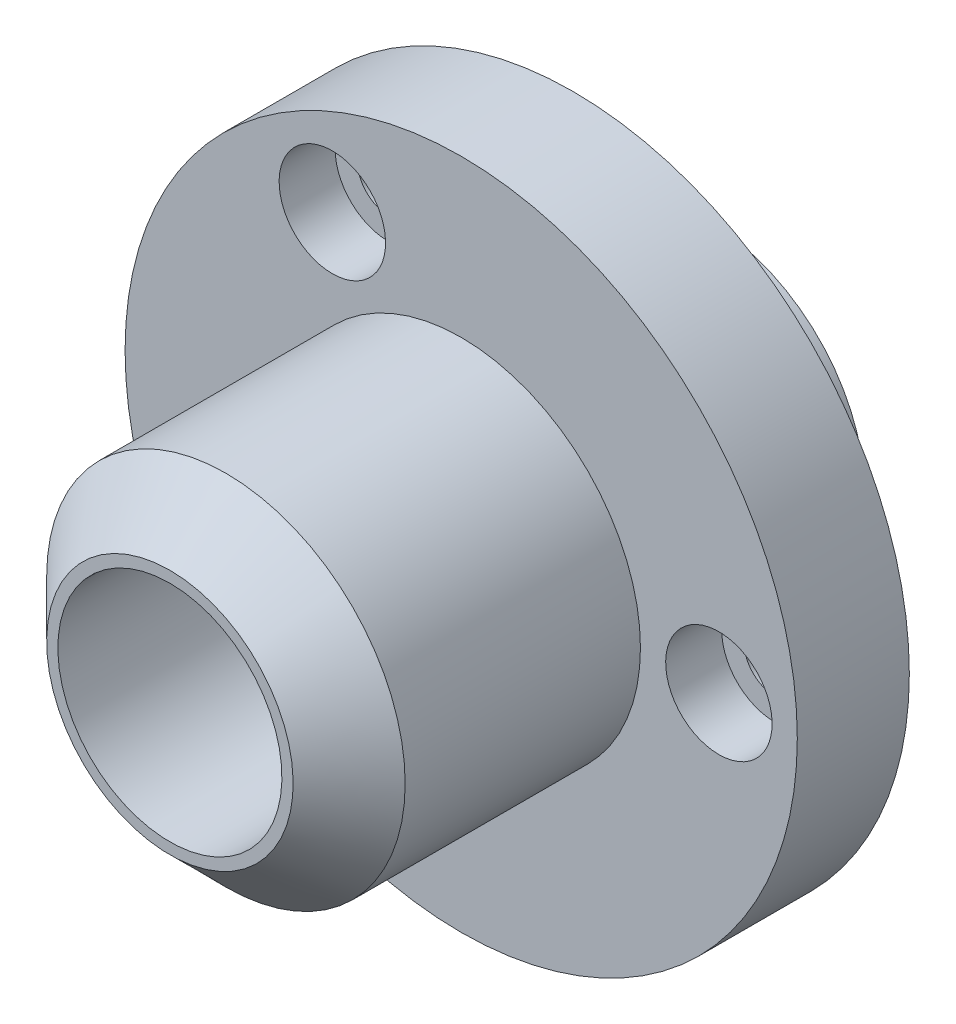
ISO-10303-21;
HEADER;
FILE_DESCRIPTION(('STEP AP214'),'2;1');
FILE_NAME('part.step','',(''),(''),'','','');
FILE_SCHEMA(('AUTOMOTIVE_DESIGN { 1 0 10303 214 1 1 1 1 }'));
ENDSEC;
DATA;
#1=APPLICATION_CONTEXT('core data for automotive mechanical design processes');
#2=APPLICATION_PROTOCOL_DEFINITION('international standard','automotive_design',2000,#1);
#3=PRODUCT_CONTEXT('',#1,'mechanical');
#4=PRODUCT('Part','Part','',(#3));
#5=PRODUCT_RELATED_PRODUCT_CATEGORY('part','',(#4));
#6=PRODUCT_DEFINITION_FORMATION('','',#4);
#7=PRODUCT_DEFINITION_CONTEXT('part definition',#1,'design');
#8=PRODUCT_DEFINITION('design','',#6,#7);
#9=PRODUCT_DEFINITION_SHAPE('','',#8);
#10=(LENGTH_UNIT() NAMED_UNIT(*) SI_UNIT(.MILLI.,.METRE.));
#11=(NAMED_UNIT(*) PLANE_ANGLE_UNIT() SI_UNIT($,.RADIAN.));
#12=(NAMED_UNIT(*) SI_UNIT($,.STERADIAN.) SOLID_ANGLE_UNIT());
#13=UNCERTAINTY_MEASURE_WITH_UNIT(LENGTH_MEASURE(1.E-05),#10,'distance_accuracy_value','');
#14=(GEOMETRIC_REPRESENTATION_CONTEXT(3) GLOBAL_UNCERTAINTY_ASSIGNED_CONTEXT((#13)) GLOBAL_UNIT_ASSIGNED_CONTEXT((#10,
#11,#12)) REPRESENTATION_CONTEXT('',''));
#15=CARTESIAN_POINT('',(0.,0.,0.));
#16=DIRECTION('',(0.,0.,1.));
#17=DIRECTION('',(1.,0.,0.));
#18=AXIS2_PLACEMENT_3D('',#15,#16,#17);
#19=CARTESIAN_POINT('',(0.,0.,0.));
#20=DIRECTION('',(0.,0.,-1.));
#21=DIRECTION('',(0.,1.,0.));
#22=AXIS2_PLACEMENT_3D('',#19,#20,#21);
#23=CYLINDRICAL_SURFACE('',#22,16.);
#24=CARTESIAN_POINT('',(0.,0.,10.));
#25=DIRECTION('',(0.,0.,-1.));
#26=DIRECTION('',(0.,1.,0.));
#27=AXIS2_PLACEMENT_3D('',#24,#25,#26);
#28=CIRCLE('',#27,16.);
#29=CARTESIAN_POINT('',(0.,16.,10.));
#30=VERTEX_POINT('',#29);
#31=EDGE_CURVE('E70',#30,#30,#28,.T.);
#32=ORIENTED_EDGE('',*,*,#31,.F.);
#33=EDGE_LOOP('',(#32));
#34=FACE_BOUND('',#33,.T.);
#35=CARTESIAN_POINT('',(0.,0.,31.));
#36=DIRECTION('',(0.,0.,-1.));
#37=DIRECTION('',(0.,1.,0.));
#38=AXIS2_PLACEMENT_3D('',#35,#36,#37);
#39=CIRCLE('',#38,16.);
#40=CARTESIAN_POINT('',(0.,16.,31.));
#41=VERTEX_POINT('',#40);
#42=EDGE_CURVE('E162',#41,#41,#39,.T.);
#43=ORIENTED_EDGE('',*,*,#42,.T.);
#44=EDGE_LOOP('',(#43));
#45=FACE_BOUND('',#44,.T.);
#46=ADVANCED_FACE('F12',(#34,#45),#23,.T.);
#47=CARTESIAN_POINT('',(10.,0.,36.));
#48=DIRECTION('',(0.,0.,1.));
#49=DIRECTION('',(0.,-1.,0.));
#50=AXIS2_PLACEMENT_3D('',#47,#48,#49);
#51=PLANE('',#50);
#52=CARTESIAN_POINT('',(0.,0.,36.));
#53=DIRECTION('',(0.,0.,-1.));
#54=DIRECTION('',(0.,1.,0.));
#55=AXIS2_PLACEMENT_3D('',#52,#53,#54);
#56=CIRCLE('',#55,10.);
#57=CARTESIAN_POINT('',(0.,10.,36.));
#58=VERTEX_POINT('',#57);
#59=EDGE_CURVE('E32',#58,#58,#56,.T.);
#60=ORIENTED_EDGE('',*,*,#59,.T.);
#61=EDGE_LOOP('',(#60));
#62=FACE_BOUND('',#61,.T.);
#63=CARTESIAN_POINT('',(0.,0.,36.));
#64=DIRECTION('',(0.,0.,-1.));
#65=DIRECTION('',(0.,1.,0.));
#66=AXIS2_PLACEMENT_3D('',#63,#64,#65);
#67=CIRCLE('',#66,11.);
#68=CARTESIAN_POINT('',(0.,11.,36.));
#69=VERTEX_POINT('',#68);
#70=EDGE_CURVE('E165',#69,#69,#67,.T.);
#71=ORIENTED_EDGE('',*,*,#70,.F.);
#72=EDGE_LOOP('',(#71));
#73=FACE_BOUND('',#72,.T.);
#74=ADVANCED_FACE('F99',(#62,#73),#51,.T.);
#75=CARTESIAN_POINT('',(0.,0.,0.));
#76=DIRECTION('',(0.,0.,-1.));
#77=DIRECTION('',(0.,1.,0.));
#78=AXIS2_PLACEMENT_3D('',#75,#76,#77);
#79=CYLINDRICAL_SURFACE('',#78,10.);
#80=ORIENTED_EDGE('',*,*,#59,.F.);
#81=EDGE_LOOP('',(#80));
#82=FACE_BOUND('',#81,.T.);
#83=CARTESIAN_POINT('',(0.,0.,6.));
#84=DIRECTION('',(0.,0.,-1.));
#85=DIRECTION('',(0.,1.,0.));
#86=AXIS2_PLACEMENT_3D('',#83,#84,#85);
#87=CIRCLE('',#86,10.);
#88=CARTESIAN_POINT('',(0.,10.,6.));
#89=VERTEX_POINT('',#88);
#90=EDGE_CURVE('E16',#89,#89,#87,.T.);
#91=ORIENTED_EDGE('',*,*,#90,.T.);
#92=EDGE_LOOP('',(#91));
#93=FACE_BOUND('',#92,.T.);
#94=ADVANCED_FACE('F14',(#82,#93),#79,.F.);
#95=CARTESIAN_POINT('',(10.,0.,-12.));
#96=DIRECTION('',(0.,0.,-1.));
#97=DIRECTION('',(0.,1.,0.));
#98=AXIS2_PLACEMENT_3D('',#95,#96,#97);
#99=PLANE('',#98);
#100=CARTESIAN_POINT('',(0.,0.,-12.));
#101=DIRECTION('',(0.,0.,-1.));
#102=DIRECTION('',(0.,1.,0.));
#103=AXIS2_PLACEMENT_3D('',#100,#101,#102);
#104=CIRCLE('',#103,10.5);
#105=CARTESIAN_POINT('',(0.,10.5,-12.));
#106=VERTEX_POINT('',#105);
#107=EDGE_CURVE('E168',#106,#106,#104,.T.);
#108=ORIENTED_EDGE('',*,*,#107,.F.);
#109=EDGE_LOOP('',(#108));
#110=FACE_BOUND('',#109,.T.);
#111=CARTESIAN_POINT('',(0.,0.,-12.));
#112=DIRECTION('',(0.,0.,-1.));
#113=DIRECTION('',(0.,1.,0.));
#114=AXIS2_PLACEMENT_3D('',#111,#112,#113);
#115=CIRCLE('',#114,14.);
#116=CARTESIAN_POINT('',(0.,14.,-12.));
#117=VERTEX_POINT('',#116);
#118=EDGE_CURVE('E8',#117,#117,#115,.T.);
#119=ORIENTED_EDGE('',*,*,#118,.T.);
#120=EDGE_LOOP('',(#119));
#121=FACE_BOUND('',#120,.T.);
#122=ADVANCED_FACE('F186',(#110,#121),#99,.T.);
#123=CARTESIAN_POINT('',(0.,0.,0.));
#124=DIRECTION('',(0.,0.,-1.));
#125=DIRECTION('',(0.,1.,0.));
#126=AXIS2_PLACEMENT_3D('',#123,#124,#125);
#127=CYLINDRICAL_SURFACE('',#126,14.);
#128=CARTESIAN_POINT('',(0.,0.,0.));
#129=DIRECTION('',(0.,0.,-1.));
#130=DIRECTION('',(0.,1.,0.));
#131=AXIS2_PLACEMENT_3D('',#128,#129,#130);
#132=CIRCLE('',#131,14.);
#133=CARTESIAN_POINT('',(0.,14.,0.));
#134=VERTEX_POINT('',#133);
#135=EDGE_CURVE('E20',#134,#134,#132,.T.);
#136=ORIENTED_EDGE('',*,*,#135,.T.);
#137=EDGE_LOOP('',(#136));
#138=FACE_BOUND('',#137,.T.);
#139=ORIENTED_EDGE('',*,*,#118,.F.);
#140=EDGE_LOOP('',(#139));
#141=FACE_BOUND('',#140,.T.);
#142=ADVANCED_FACE('F95',(#138,#141),#127,.T.);
#143=CARTESIAN_POINT('',(14.,0.,0.));
#144=DIRECTION('',(0.,0.,-1.));
#145=DIRECTION('',(0.,1.,0.));
#146=AXIS2_PLACEMENT_3D('',#143,#144,#145);
#147=PLANE('',#146);
#148=CARTESIAN_POINT('',(-11.4999999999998,-19.9185842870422,0.));
#149=DIRECTION('',(0.,0.,-1.));
#150=DIRECTION('',(0.,1.,0.));
#151=AXIS2_PLACEMENT_3D('',#148,#149,#150);
#152=CIRCLE('',#151,2.75);
#153=CARTESIAN_POINT('',(-11.4999999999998,-17.1685842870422,0.));
#154=VERTEX_POINT('',#153);
#155=EDGE_CURVE('E38',#154,#154,#152,.T.);
#156=ORIENTED_EDGE('',*,*,#155,.F.);
#157=EDGE_LOOP('',(#156));
#158=FACE_BOUND('',#157,.T.);
#159=CARTESIAN_POINT('',(-11.5,19.918584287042,0.));
#160=DIRECTION('',(0.,0.,-1.));
#161=DIRECTION('',(0.,1.,0.));
#162=AXIS2_PLACEMENT_3D('',#159,#160,#161);
#163=CIRCLE('',#162,2.75);
#164=CARTESIAN_POINT('',(-11.5,22.668584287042,0.));
#165=VERTEX_POINT('',#164);
#166=EDGE_CURVE('E34',#165,#165,#163,.T.);
#167=ORIENTED_EDGE('',*,*,#166,.F.);
#168=EDGE_LOOP('',(#167));
#169=FACE_BOUND('',#168,.T.);
#170=CARTESIAN_POINT('',(23.,0.,0.));
#171=DIRECTION('',(0.,0.,-1.));
#172=DIRECTION('',(0.,1.,0.));
#173=AXIS2_PLACEMENT_3D('',#170,#171,#172);
#174=CIRCLE('',#173,2.75);
#175=CARTESIAN_POINT('',(23.,2.75000000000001,0.));
#176=VERTEX_POINT('',#175);
#177=EDGE_CURVE('E29',#176,#176,#174,.T.);
#178=ORIENTED_EDGE('',*,*,#177,.F.);
#179=EDGE_LOOP('',(#178));
#180=FACE_BOUND('',#179,.T.);
#181=CARTESIAN_POINT('',(0.,0.,0.));
#182=DIRECTION('',(0.,0.,-1.));
#183=DIRECTION('',(0.,1.,0.));
#184=AXIS2_PLACEMENT_3D('',#181,#182,#183);
#185=CIRCLE('',#184,30.);
#186=CARTESIAN_POINT('',(0.,30.,0.));
#187=VERTEX_POINT('',#186);
#188=EDGE_CURVE('E25',#187,#187,#185,.T.);
#189=ORIENTED_EDGE('',*,*,#188,.T.);
#190=EDGE_LOOP('',(#189));
#191=FACE_BOUND('',#190,.T.);
#192=ORIENTED_EDGE('',*,*,#135,.F.);
#193=EDGE_LOOP('',(#192));
#194=FACE_BOUND('',#193,.T.);
#195=ADVANCED_FACE('F78',(#158,#169,#180,#191,#194),#147,.T.);
#196=CARTESIAN_POINT('',(0.,0.,0.));
#197=DIRECTION('',(0.,0.,-1.));
#198=DIRECTION('',(0.,1.,0.));
#199=AXIS2_PLACEMENT_3D('',#196,#197,#198);
#200=CYLINDRICAL_SURFACE('',#199,30.);
#201=CARTESIAN_POINT('',(0.,0.,10.));
#202=DIRECTION('',(0.,0.,-1.));
#203=DIRECTION('',(0.,1.,0.));
#204=AXIS2_PLACEMENT_3D('',#201,#202,#203);
#205=CIRCLE('',#204,30.);
#206=CARTESIAN_POINT('',(0.,30.,10.));
#207=VERTEX_POINT('',#206);
#208=EDGE_CURVE('E73',#207,#207,#205,.T.);
#209=ORIENTED_EDGE('',*,*,#208,.T.);
#210=EDGE_LOOP('',(#209));
#211=FACE_BOUND('',#210,.T.);
#212=ORIENTED_EDGE('',*,*,#188,.F.);
#213=EDGE_LOOP('',(#212));
#214=FACE_BOUND('',#213,.T.);
#215=ADVANCED_FACE('F81',(#211,#214),#200,.T.);
#216=CARTESIAN_POINT('',(16.,0.,10.));
#217=DIRECTION('',(0.,0.,1.));
#218=DIRECTION('',(0.,-1.,0.));
#219=AXIS2_PLACEMENT_3D('',#216,#217,#218);
#220=PLANE('',#219);
#221=CARTESIAN_POINT('',(-11.4999999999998,-19.9185842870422,10.));
#222=DIRECTION('',(0.,0.,1.));
#223=DIRECTION('',(0.,-1.,0.));
#224=AXIS2_PLACEMENT_3D('',#221,#222,#223);
#225=CIRCLE('',#224,4.75);
#226=CARTESIAN_POINT('',(-11.4999999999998,-24.6685842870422,10.));
#227=VERTEX_POINT('',#226);
#228=EDGE_CURVE('E41',#227,#227,#225,.T.);
#229=ORIENTED_EDGE('',*,*,#228,.F.);
#230=EDGE_LOOP('',(#229));
#231=FACE_BOUND('',#230,.T.);
#232=CARTESIAN_POINT('',(-11.5,19.918584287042,10.));
#233=DIRECTION('',(0.,0.,1.));
#234=DIRECTION('',(0.,-1.,0.));
#235=AXIS2_PLACEMENT_3D('',#232,#233,#234);
#236=CIRCLE('',#235,4.75);
#237=CARTESIAN_POINT('',(-11.5,15.168584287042,10.));
#238=VERTEX_POINT('',#237);
#239=EDGE_CURVE('E37',#238,#238,#236,.T.);
#240=ORIENTED_EDGE('',*,*,#239,.F.);
#241=EDGE_LOOP('',(#240));
#242=FACE_BOUND('',#241,.T.);
#243=CARTESIAN_POINT('',(23.,0.,10.));
#244=DIRECTION('',(0.,0.,1.));
#245=DIRECTION('',(0.,-1.,0.));
#246=AXIS2_PLACEMENT_3D('',#243,#244,#245);
#247=CIRCLE('',#246,4.75);
#248=CARTESIAN_POINT('',(23.,-4.74999999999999,10.));
#249=VERTEX_POINT('',#248);
#250=EDGE_CURVE('E33',#249,#249,#247,.T.);
#251=ORIENTED_EDGE('',*,*,#250,.F.);
#252=EDGE_LOOP('',(#251));
#253=FACE_BOUND('',#252,.T.);
#254=ORIENTED_EDGE('',*,*,#31,.T.);
#255=EDGE_LOOP('',(#254));
#256=FACE_BOUND('',#255,.T.);
#257=ORIENTED_EDGE('',*,*,#208,.F.);
#258=EDGE_LOOP('',(#257));
#259=FACE_BOUND('',#258,.T.);
#260=ADVANCED_FACE('F83',(#231,#242,#253,#256,#259),#220,.T.);
#261=CARTESIAN_POINT('',(23.,0.,10.));
#262=DIRECTION('',(0.,0.,1.));
#263=DIRECTION('',(0.,-1.,0.));
#264=AXIS2_PLACEMENT_3D('',#261,#262,#263);
#265=CYLINDRICAL_SURFACE('',#264,4.75);
#266=CARTESIAN_POINT('',(23.,0.,5.));
#267=DIRECTION('',(0.,0.,1.));
#268=DIRECTION('',(0.,-1.,0.));
#269=AXIS2_PLACEMENT_3D('',#266,#267,#268);
#270=CIRCLE('',#269,4.75);
#271=CARTESIAN_POINT('',(23.,-4.74999999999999,5.));
#272=VERTEX_POINT('',#271);
#273=EDGE_CURVE('E63',#272,#272,#270,.T.);
#274=ORIENTED_EDGE('',*,*,#273,.F.);
#275=EDGE_LOOP('',(#274));
#276=FACE_BOUND('',#275,.T.);
#277=ORIENTED_EDGE('',*,*,#250,.T.);
#278=EDGE_LOOP('',(#277));
#279=FACE_BOUND('',#278,.T.);
#280=ADVANCED_FACE('F92',(#276,#279),#265,.F.);
#281=CARTESIAN_POINT('',(25.75,0.,5.));
#282=DIRECTION('',(0.,0.,-1.));
#283=DIRECTION('',(0.,1.,0.));
#284=AXIS2_PLACEMENT_3D('',#281,#282,#283);
#285=PLANE('',#284);
#286=CARTESIAN_POINT('',(23.,0.,5.));
#287=DIRECTION('',(0.,0.,1.));
#288=DIRECTION('',(0.,-1.,0.));
#289=AXIS2_PLACEMENT_3D('',#286,#287,#288);
#290=CIRCLE('',#289,2.75);
#291=CARTESIAN_POINT('',(23.,-2.74999999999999,5.));
#292=VERTEX_POINT('',#291);
#293=EDGE_CURVE('E36',#292,#292,#290,.T.);
#294=ORIENTED_EDGE('',*,*,#293,.F.);
#295=EDGE_LOOP('',(#294));
#296=FACE_BOUND('',#295,.T.);
#297=ORIENTED_EDGE('',*,*,#273,.T.);
#298=EDGE_LOOP('',(#297));
#299=FACE_BOUND('',#298,.T.);
#300=ADVANCED_FACE('F113',(#296,#299),#285,.F.);
#301=CARTESIAN_POINT('',(23.,0.,10.));
#302=DIRECTION('',(0.,0.,1.));
#303=DIRECTION('',(0.,-1.,0.));
#304=AXIS2_PLACEMENT_3D('',#301,#302,#303);
#305=CYLINDRICAL_SURFACE('',#304,2.75);
#306=ORIENTED_EDGE('',*,*,#177,.T.);
#307=EDGE_LOOP('',(#306));
#308=FACE_BOUND('',#307,.T.);
#309=ORIENTED_EDGE('',*,*,#293,.T.);
#310=EDGE_LOOP('',(#309));
#311=FACE_BOUND('',#310,.T.);
#312=ADVANCED_FACE('F117',(#308,#311),#305,.F.);
#313=CARTESIAN_POINT('',(-11.5,19.918584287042,10.));
#314=DIRECTION('',(0.,0.,1.));
#315=DIRECTION('',(0.,-1.,0.));
#316=AXIS2_PLACEMENT_3D('',#313,#314,#315);
#317=CYLINDRICAL_SURFACE('',#316,4.75);
#318=CARTESIAN_POINT('',(-11.5,19.918584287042,5.));
#319=DIRECTION('',(0.,0.,1.));
#320=DIRECTION('',(0.,-1.,0.));
#321=AXIS2_PLACEMENT_3D('',#318,#319,#320);
#322=CIRCLE('',#321,4.75);
#323=CARTESIAN_POINT('',(-11.5,15.168584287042,5.));
#324=VERTEX_POINT('',#323);
#325=EDGE_CURVE('E45',#324,#324,#322,.T.);
#326=ORIENTED_EDGE('',*,*,#325,.F.);
#327=EDGE_LOOP('',(#326));
#328=FACE_BOUND('',#327,.T.);
#329=ORIENTED_EDGE('',*,*,#239,.T.);
#330=EDGE_LOOP('',(#329));
#331=FACE_BOUND('',#330,.T.);
#332=ADVANCED_FACE('F121',(#328,#331),#317,.F.);
#333=CARTESIAN_POINT('',(-8.75,19.918584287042,5.));
#334=DIRECTION('',(0.,0.,-1.));
#335=DIRECTION('',(0.,1.,0.));
#336=AXIS2_PLACEMENT_3D('',#333,#334,#335);
#337=PLANE('',#336);
#338=CARTESIAN_POINT('',(-11.5,19.918584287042,5.));
#339=DIRECTION('',(0.,0.,1.));
#340=DIRECTION('',(0.,-1.,0.));
#341=AXIS2_PLACEMENT_3D('',#338,#339,#340);
#342=CIRCLE('',#341,2.75);
#343=CARTESIAN_POINT('',(-11.5,17.1685842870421,5.));
#344=VERTEX_POINT('',#343);
#345=EDGE_CURVE('E40',#344,#344,#342,.T.);
#346=ORIENTED_EDGE('',*,*,#345,.F.);
#347=EDGE_LOOP('',(#346));
#348=FACE_BOUND('',#347,.T.);
#349=ORIENTED_EDGE('',*,*,#325,.T.);
#350=EDGE_LOOP('',(#349));
#351=FACE_BOUND('',#350,.T.);
#352=ADVANCED_FACE('F125',(#348,#351),#337,.F.);
#353=CARTESIAN_POINT('',(-11.5,19.918584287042,10.));
#354=DIRECTION('',(0.,0.,1.));
#355=DIRECTION('',(0.,-1.,0.));
#356=AXIS2_PLACEMENT_3D('',#353,#354,#355);
#357=CYLINDRICAL_SURFACE('',#356,2.75);
#358=ORIENTED_EDGE('',*,*,#166,.T.);
#359=EDGE_LOOP('',(#358));
#360=FACE_BOUND('',#359,.T.);
#361=ORIENTED_EDGE('',*,*,#345,.T.);
#362=EDGE_LOOP('',(#361));
#363=FACE_BOUND('',#362,.T.);
#364=ADVANCED_FACE('F129',(#360,#363),#357,.F.);
#365=CARTESIAN_POINT('',(-11.4999999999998,-19.9185842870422,10.));
#366=DIRECTION('',(0.,0.,1.));
#367=DIRECTION('',(0.,-1.,0.));
#368=AXIS2_PLACEMENT_3D('',#365,#366,#367);
#369=CYLINDRICAL_SURFACE('',#368,4.75);
#370=CARTESIAN_POINT('',(-11.4999999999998,-19.9185842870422,5.));
#371=DIRECTION('',(0.,0.,1.));
#372=DIRECTION('',(0.,-1.,0.));
#373=AXIS2_PLACEMENT_3D('',#370,#371,#372);
#374=CIRCLE('',#373,4.75);
#375=CARTESIAN_POINT('',(-11.4999999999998,-24.6685842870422,5.));
#376=VERTEX_POINT('',#375);
#377=EDGE_CURVE('E48',#376,#376,#374,.T.);
#378=ORIENTED_EDGE('',*,*,#377,.F.);
#379=EDGE_LOOP('',(#378));
#380=FACE_BOUND('',#379,.T.);
#381=ORIENTED_EDGE('',*,*,#228,.T.);
#382=EDGE_LOOP('',(#381));
#383=FACE_BOUND('',#382,.T.);
#384=ADVANCED_FACE('F133',(#380,#383),#369,.F.);
#385=CARTESIAN_POINT('',(-8.7499999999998,-19.9185842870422,5.));
#386=DIRECTION('',(0.,0.,-1.));
#387=DIRECTION('',(0.,1.,0.));
#388=AXIS2_PLACEMENT_3D('',#385,#386,#387);
#389=PLANE('',#388);
#390=CARTESIAN_POINT('',(-11.4999999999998,-19.9185842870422,5.));
#391=DIRECTION('',(0.,0.,1.));
#392=DIRECTION('',(0.,-1.,0.));
#393=AXIS2_PLACEMENT_3D('',#390,#391,#392);
#394=CIRCLE('',#393,2.75);
#395=CARTESIAN_POINT('',(-11.4999999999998,-22.6685842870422,5.));
#396=VERTEX_POINT('',#395);
#397=EDGE_CURVE('E53',#396,#396,#394,.T.);
#398=ORIENTED_EDGE('',*,*,#397,.F.);
#399=EDGE_LOOP('',(#398));
#400=FACE_BOUND('',#399,.T.);
#401=ORIENTED_EDGE('',*,*,#377,.T.);
#402=EDGE_LOOP('',(#401));
#403=FACE_BOUND('',#402,.T.);
#404=ADVANCED_FACE('F137',(#400,#403),#389,.F.);
#405=CARTESIAN_POINT('',(-11.4999999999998,-19.9185842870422,10.));
#406=DIRECTION('',(0.,0.,1.));
#407=DIRECTION('',(0.,-1.,0.));
#408=AXIS2_PLACEMENT_3D('',#405,#406,#407);
#409=CYLINDRICAL_SURFACE('',#408,2.75);
#410=ORIENTED_EDGE('',*,*,#155,.T.);
#411=EDGE_LOOP('',(#410));
#412=FACE_BOUND('',#411,.T.);
#413=ORIENTED_EDGE('',*,*,#397,.T.);
#414=EDGE_LOOP('',(#413));
#415=FACE_BOUND('',#414,.T.);
#416=ADVANCED_FACE('F141',(#412,#415),#409,.F.);
#417=CARTESIAN_POINT('',(0.,0.,6.));
#418=DIRECTION('',(0.,0.,-1.));
#419=DIRECTION('',(0.,1.,0.));
#420=AXIS2_PLACEMENT_3D('',#417,#418,#419);
#421=CYLINDRICAL_SURFACE('',#420,10.5);
#422=CARTESIAN_POINT('',(0.,0.,6.));
#423=DIRECTION('',(0.,0.,-1.));
#424=DIRECTION('',(0.,1.,0.));
#425=AXIS2_PLACEMENT_3D('',#422,#423,#424);
#426=CIRCLE('',#425,10.5);
#427=CARTESIAN_POINT('',(0.,10.5,6.));
#428=VERTEX_POINT('',#427);
#429=EDGE_CURVE('E173',#428,#428,#426,.T.);
#430=ORIENTED_EDGE('',*,*,#429,.F.);
#431=EDGE_LOOP('',(#430));
#432=FACE_BOUND('',#431,.T.);
#433=ORIENTED_EDGE('',*,*,#107,.T.);
#434=EDGE_LOOP('',(#433));
#435=FACE_BOUND('',#434,.T.);
#436=ADVANCED_FACE('F145',(#432,#435),#421,.F.);
#437=CARTESIAN_POINT('',(0.,0.,6.));
#438=DIRECTION('',(0.,0.,-1.));
#439=DIRECTION('',(0.,1.,0.));
#440=AXIS2_PLACEMENT_3D('',#437,#438,#439);
#441=PLANE('',#440);
#442=ORIENTED_EDGE('',*,*,#90,.F.);
#443=EDGE_LOOP('',(#442));
#444=FACE_BOUND('',#443,.T.);
#445=ORIENTED_EDGE('',*,*,#429,.T.);
#446=EDGE_LOOP('',(#445));
#447=FACE_BOUND('',#446,.T.);
#448=ADVANCED_FACE('F148',(#444,#447),#441,.T.);
#449=CARTESIAN_POINT('',(0.,0.,25.8019609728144));
#450=DIRECTION('',(0.,0.,-1.));
#451=DIRECTION('',(0.,1.,0.));
#452=AXIS2_PLACEMENT_3D('',#449,#450,#451);
#453=CONICAL_SURFACE('',#452,21.1980390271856,0.78539816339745);
#454=ORIENTED_EDGE('',*,*,#42,.F.);
#455=EDGE_LOOP('',(#454));
#456=FACE_BOUND('',#455,.T.);
#457=ORIENTED_EDGE('',*,*,#70,.T.);
#458=EDGE_LOOP('',(#457));
#459=FACE_BOUND('',#458,.T.);
#460=ADVANCED_FACE('F152',(#456,#459),#453,.T.);
#461=CLOSED_SHELL('',(#46,#74,#94,#122,#142,#195,#215,#260,#280,#300,#312,#332,#352,#364,#384,
#404,#416,#436,#448,#460));
#462=MANIFOLD_SOLID_BREP('B1',#461);
#463=ADVANCED_BREP_SHAPE_REPRESENTATION('',(#18,#462),#14);
#464=SHAPE_DEFINITION_REPRESENTATION(#9,#463);
ENDSEC;
END-ISO-10303-21;
